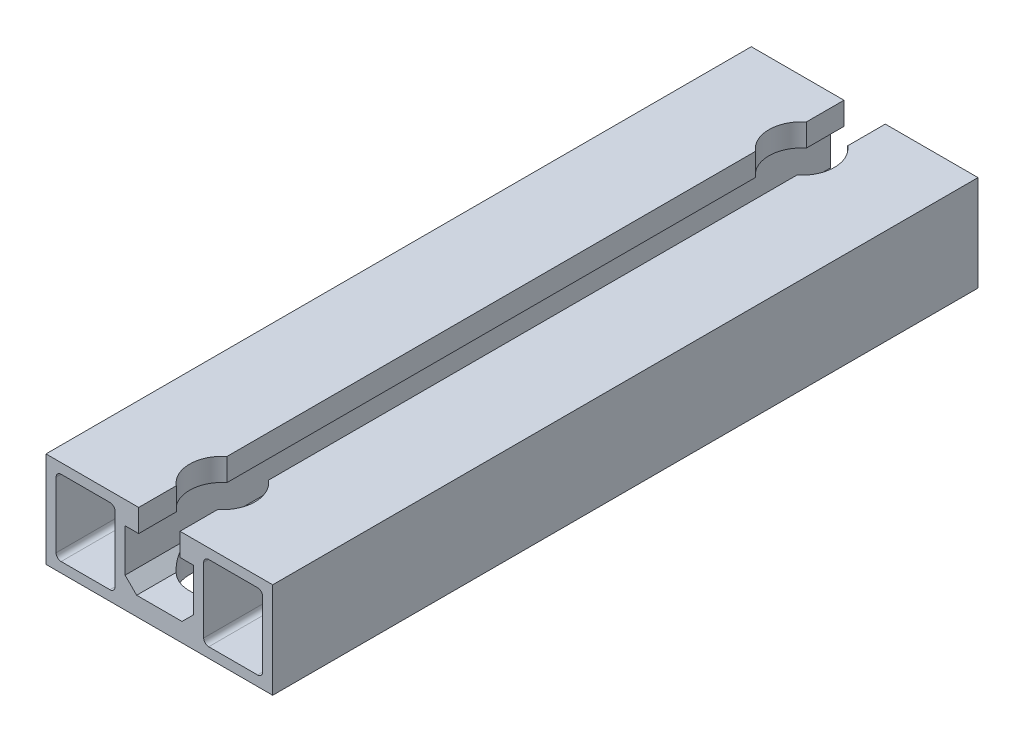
ISO-10303-21;
HEADER;
FILE_DESCRIPTION(('STEP AP214'),'2;1');
FILE_NAME('part.step','',(''),(''),'','','');
FILE_SCHEMA(('AUTOMOTIVE_DESIGN { 1 0 10303 214 1 1 1 1 }'));
ENDSEC;
DATA;
#1=APPLICATION_CONTEXT('core data for automotive mechanical design processes');
#2=APPLICATION_PROTOCOL_DEFINITION('international standard','automotive_design',2000,#1);
#3=PRODUCT_CONTEXT('',#1,'mechanical');
#4=PRODUCT('Part','Part','',(#3));
#5=PRODUCT_RELATED_PRODUCT_CATEGORY('part','',(#4));
#6=PRODUCT_DEFINITION_FORMATION('','',#4);
#7=PRODUCT_DEFINITION_CONTEXT('part definition',#1,'design');
#8=PRODUCT_DEFINITION('design','',#6,#7);
#9=PRODUCT_DEFINITION_SHAPE('','',#8);
#10=(LENGTH_UNIT() NAMED_UNIT(*) SI_UNIT(.MILLI.,.METRE.));
#11=(NAMED_UNIT(*) PLANE_ANGLE_UNIT() SI_UNIT($,.RADIAN.));
#12=(NAMED_UNIT(*) SI_UNIT($,.STERADIAN.) SOLID_ANGLE_UNIT());
#13=UNCERTAINTY_MEASURE_WITH_UNIT(LENGTH_MEASURE(1.E-05),#10,'distance_accuracy_value','');
#14=(GEOMETRIC_REPRESENTATION_CONTEXT(3) GLOBAL_UNCERTAINTY_ASSIGNED_CONTEXT((#13)) GLOBAL_UNIT_ASSIGNED_CONTEXT((#10,
#11,#12)) REPRESENTATION_CONTEXT('',''));
#15=CARTESIAN_POINT('',(0.,0.,0.));
#16=DIRECTION('',(0.,0.,1.));
#17=DIRECTION('',(1.,0.,0.));
#18=AXIS2_PLACEMENT_3D('',#15,#16,#17);
#19=CARTESIAN_POINT('',(4.50000000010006,-5.7999999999,-70.));
#20=DIRECTION('',(0.,1.,0.));
#21=DIRECTION('',(0.,0.,1.));
#22=AXIS2_PLACEMENT_3D('',#19,#20,#21);
#23=PLANE('',#22);
#24=CARTESIAN_POINT('',(0.,-5.7999999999,-57.5));
#25=DIRECTION('',(0.,1.,0.));
#26=DIRECTION('',(0.,0.,1.));
#27=AXIS2_PLACEMENT_3D('',#24,#25,#26);
#28=CIRCLE('',#27,6.5);
#29=CARTESIAN_POINT('',(4.50000000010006,-5.7999999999,-62.1904157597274));
#30=VERTEX_POINT('',#29);
#31=CARTESIAN_POINT('',(-4.49999999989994,-5.7999999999,-62.1904157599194));
#32=VERTEX_POINT('',#31);
#33=EDGE_CURVE('E637',#30,#32,#28,.T.);
#34=ORIENTED_EDGE('',*,*,#33,.F.);
#35=DIRECTION('',(0.,0.,1.));
#36=VECTOR('',#35,1.);
#37=CARTESIAN_POINT('',(4.50000000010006,-5.7999999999,-70.));
#38=LINE('',#37,#36);
#39=CARTESIAN_POINT('',(4.50000000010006,-5.7999999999,-70.));
#40=VERTEX_POINT('',#39);
#41=EDGE_CURVE('E377',#40,#30,#38,.T.);
#42=ORIENTED_EDGE('',*,*,#41,.F.);
#43=DIRECTION('',(-1.,0.,0.));
#44=VECTOR('',#43,1.);
#45=CARTESIAN_POINT('',(4.50000000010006,-5.7999999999,-70.));
#46=LINE('',#45,#44);
#47=CARTESIAN_POINT('',(-4.49999999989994,-5.7999999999,-70.));
#48=VERTEX_POINT('',#47);
#49=EDGE_CURVE('E613',#40,#48,#46,.T.);
#50=ORIENTED_EDGE('',*,*,#49,.T.);
#51=DIRECTION('',(0.,0.,1.));
#52=VECTOR('',#51,1.);
#53=CARTESIAN_POINT('',(-4.49999999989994,-5.7999999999,-70.));
#54=LINE('',#53,#52);
#55=EDGE_CURVE('E372',#48,#32,#54,.T.);
#56=ORIENTED_EDGE('',*,*,#55,.T.);
#57=EDGE_LOOP('',(#34,#42,#50,#56));
#58=FACE_BOUND('',#57,.T.);
#59=ADVANCED_FACE('F30',(#58),#23,.T.);
#60=CARTESIAN_POINT('',(4.10000000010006,9.50000000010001,-70.));
#61=DIRECTION('',(-1.,0.,0.));
#62=DIRECTION('',(0.,0.,1.));
#63=AXIS2_PLACEMENT_3D('',#60,#61,#62);
#64=PLANE('',#63);
#65=DIRECTION('',(0.,-1.,0.));
#66=VECTOR('',#65,1.);
#67=CARTESIAN_POINT('',(4.10000000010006,60.5,-62.5438080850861));
#68=LINE('',#67,#66);
#69=CARTESIAN_POINT('',(4.10000000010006,9.50000000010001,-62.5438080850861));
#70=VERTEX_POINT('',#69);
#71=CARTESIAN_POINT('',(4.10000000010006,5.0000000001,-62.5438080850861));
#72=VERTEX_POINT('',#71);
#73=EDGE_CURVE('E304',#70,#72,#68,.T.);
#74=ORIENTED_EDGE('',*,*,#73,.F.);
#75=DIRECTION('',(0.,0.,1.));
#76=VECTOR('',#75,1.);
#77=CARTESIAN_POINT('',(4.10000000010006,9.50000000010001,-70.));
#78=LINE('',#77,#76);
#79=CARTESIAN_POINT('',(4.10000000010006,9.50000000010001,-70.));
#80=VERTEX_POINT('',#79);
#81=EDGE_CURVE('E317',#80,#70,#78,.T.);
#82=ORIENTED_EDGE('',*,*,#81,.F.);
#83=DIRECTION('',(0.,-1.,0.));
#84=VECTOR('',#83,1.);
#85=CARTESIAN_POINT('',(4.10000000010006,9.50000000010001,-70.));
#86=LINE('',#85,#84);
#87=CARTESIAN_POINT('',(4.10000000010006,5.0000000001,-70.));
#88=VERTEX_POINT('',#87);
#89=EDGE_CURVE('E602',#80,#88,#86,.T.);
#90=ORIENTED_EDGE('',*,*,#89,.T.);
#91=DIRECTION('',(0.,0.,1.));
#92=VECTOR('',#91,1.);
#93=CARTESIAN_POINT('',(4.10000000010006,5.0000000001,-70.));
#94=LINE('',#93,#92);
#95=EDGE_CURVE('E319',#88,#72,#94,.T.);
#96=ORIENTED_EDGE('',*,*,#95,.T.);
#97=EDGE_LOOP('',(#74,#82,#90,#96));
#98=FACE_BOUND('',#97,.T.);
#99=ADVANCED_FACE('F315',(#98),#64,.T.);
#100=CARTESIAN_POINT('',(-4.09999999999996,4.99999999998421,-70.));
#101=DIRECTION('',(1.,0.,0.));
#102=DIRECTION('',(0.,0.,-1.));
#103=AXIS2_PLACEMENT_3D('',#100,#101,#102);
#104=PLANE('',#103);
#105=DIRECTION('',(0.,-1.,0.));
#106=VECTOR('',#105,1.);
#107=CARTESIAN_POINT('',(-4.09999999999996,60.5,-52.4561919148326));
#108=LINE('',#107,#106);
#109=CARTESIAN_POINT('',(-4.09999999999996,9.50000000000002,-52.4561919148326));
#110=VERTEX_POINT('',#109);
#111=CARTESIAN_POINT('',(-4.09999999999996,4.99999999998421,-52.4561919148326));
#112=VERTEX_POINT('',#111);
#113=EDGE_CURVE('E48',#110,#112,#108,.T.);
#114=ORIENTED_EDGE('',*,*,#113,.F.);
#115=DIRECTION('',(0.,0.,1.));
#116=VECTOR('',#115,1.);
#117=CARTESIAN_POINT('',(-4.09999999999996,9.50000000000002,-70.));
#118=LINE('',#117,#116);
#119=CARTESIAN_POINT('',(-4.09999999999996,9.50000000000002,52.4561920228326));
#120=VERTEX_POINT('',#119);
#121=EDGE_CURVE('E39',#110,#120,#118,.T.);
#122=ORIENTED_EDGE('',*,*,#121,.T.);
#123=DIRECTION('',(0.,-1.,0.));
#124=VECTOR('',#123,1.);
#125=CARTESIAN_POINT('',(-4.09999999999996,60.5,52.4561920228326));
#126=LINE('',#125,#124);
#127=CARTESIAN_POINT('',(-4.09999999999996,4.99999999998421,52.4561920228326));
#128=VERTEX_POINT('',#127);
#129=EDGE_CURVE('E418',#128,#120,#126,.F.);
#130=ORIENTED_EDGE('',*,*,#129,.F.);
#131=DIRECTION('',(0.,0.,1.));
#132=VECTOR('',#131,1.);
#133=CARTESIAN_POINT('',(-4.09999999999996,4.99999999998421,-70.));
#134=LINE('',#133,#132);
#135=EDGE_CURVE('E366',#112,#128,#134,.T.);
#136=ORIENTED_EDGE('',*,*,#135,.F.);
#137=EDGE_LOOP('',(#114,#122,#130,#136));
#138=FACE_BOUND('',#137,.T.);
#139=ADVANCED_FACE('F682',(#138),#104,.T.);
#140=DIRECTION('',(0.,-1.,0.));
#141=VECTOR('',#140,1.);
#142=CARTESIAN_POINT('',(-4.09999999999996,60.5,62.5438081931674));
#143=LINE('',#142,#141);
#144=CARTESIAN_POINT('',(-4.09999999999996,9.50000000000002,62.5438081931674));
#145=VERTEX_POINT('',#144);
#146=CARTESIAN_POINT('',(-4.09999999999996,4.99999999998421,62.5438081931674));
#147=VERTEX_POINT('',#146);
#148=EDGE_CURVE('E421',#145,#147,#143,.T.);
#149=ORIENTED_EDGE('',*,*,#148,.F.);
#150=CARTESIAN_POINT('',(-4.09999999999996,9.50000000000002,70.));
#151=VERTEX_POINT('',#150);
#152=EDGE_CURVE('E41',#145,#151,#118,.T.);
#153=ORIENTED_EDGE('',*,*,#152,.T.);
#154=DIRECTION('',(0.,1.,0.));
#155=VECTOR('',#154,1.);
#156=CARTESIAN_POINT('',(-4.09999999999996,4.99999999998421,70.));
#157=LINE('',#156,#155);
#158=CARTESIAN_POINT('',(-4.09999999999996,4.99999999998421,70.));
#159=VERTEX_POINT('',#158);
#160=EDGE_CURVE('E509',#159,#151,#157,.T.);
#161=ORIENTED_EDGE('',*,*,#160,.F.);
#162=EDGE_CURVE('E367',#147,#159,#134,.T.);
#163=ORIENTED_EDGE('',*,*,#162,.F.);
#164=EDGE_LOOP('',(#149,#153,#161,#163));
#165=FACE_BOUND('',#164,.T.);
#166=ADVANCED_FACE('F677',(#165),#104,.T.);
#167=CARTESIAN_POINT('',(-4.49999999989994,-5.7999999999,-52.8095842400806));
#168=VERTEX_POINT('',#167);
#169=CARTESIAN_POINT('',(4.50000000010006,-5.7999999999,-52.8095842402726));
#170=VERTEX_POINT('',#169);
#171=EDGE_CURVE('E56',#168,#170,#28,.T.);
#172=ORIENTED_EDGE('',*,*,#171,.F.);
#173=CARTESIAN_POINT('',(-4.49999999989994,-5.7999999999,52.8095843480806));
#174=VERTEX_POINT('',#173);
#175=EDGE_CURVE('E375',#168,#174,#54,.T.);
#176=ORIENTED_EDGE('',*,*,#175,.T.);
#177=CARTESIAN_POINT('',(0.,-5.7999999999,57.500000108));
#178=DIRECTION('',(0.,1.,0.));
#179=DIRECTION('',(0.,0.,1.));
#180=AXIS2_PLACEMENT_3D('',#177,#178,#179);
#181=CIRCLE('',#180,6.5);
#182=CARTESIAN_POINT('',(4.50000000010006,-5.7999999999,52.8095843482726));
#183=VERTEX_POINT('',#182);
#184=EDGE_CURVE('E412',#183,#174,#181,.T.);
#185=ORIENTED_EDGE('',*,*,#184,.F.);
#186=EDGE_CURVE('E380',#170,#183,#38,.T.);
#187=ORIENTED_EDGE('',*,*,#186,.F.);
#188=EDGE_LOOP('',(#172,#176,#185,#187));
#189=FACE_BOUND('',#188,.T.);
#190=ADVANCED_FACE('F700',(#189),#23,.T.);
#191=DIRECTION('',(0.,-1.,0.));
#192=VECTOR('',#191,1.);
#193=CARTESIAN_POINT('',(4.10000000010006,60.5,-52.456191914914));
#194=LINE('',#193,#192);
#195=CARTESIAN_POINT('',(4.10000000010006,5.0000000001,-52.456191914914));
#196=VERTEX_POINT('',#195);
#197=CARTESIAN_POINT('',(4.10000000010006,9.50000000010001,-52.456191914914));
#198=VERTEX_POINT('',#197);
#199=EDGE_CURVE('E307',#196,#198,#194,.F.);
#200=ORIENTED_EDGE('',*,*,#199,.F.);
#201=CARTESIAN_POINT('',(4.10000000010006,5.0000000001,52.4561920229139));
#202=VERTEX_POINT('',#201);
#203=EDGE_CURVE('E330',#196,#202,#94,.T.);
#204=ORIENTED_EDGE('',*,*,#203,.T.);
#205=DIRECTION('',(0.,-1.,0.));
#206=VECTOR('',#205,1.);
#207=CARTESIAN_POINT('',(4.10000000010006,60.5,52.4561920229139));
#208=LINE('',#207,#206);
#209=CARTESIAN_POINT('',(4.10000000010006,9.50000000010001,52.4561920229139));
#210=VERTEX_POINT('',#209);
#211=EDGE_CURVE('E390',#210,#202,#208,.T.);
#212=ORIENTED_EDGE('',*,*,#211,.F.);
#213=EDGE_CURVE('E327',#198,#210,#78,.T.);
#214=ORIENTED_EDGE('',*,*,#213,.F.);
#215=EDGE_LOOP('',(#200,#204,#212,#214));
#216=FACE_BOUND('',#215,.T.);
#217=ADVANCED_FACE('F389',(#216),#64,.T.);
#218=CARTESIAN_POINT('',(-4.09999999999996,9.50000000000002,-70.));
#219=DIRECTION('',(0.,1.,0.));
#220=DIRECTION('',(-1.,0.,0.));
#221=AXIS2_PLACEMENT_3D('',#218,#219,#220);
#222=PLANE('',#221);
#223=CARTESIAN_POINT('',(0.,9.50000000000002,-57.5));
#224=DIRECTION('',(0.,1.,0.));
#225=DIRECTION('',(-1.,0.,0.));
#226=AXIS2_PLACEMENT_3D('',#223,#224,#225);
#227=CIRCLE('',#226,6.5);
#228=CARTESIAN_POINT('',(-4.09999999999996,9.50000000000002,-62.5438080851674));
#229=VERTEX_POINT('',#228);
#230=EDGE_CURVE('E662',#229,#110,#227,.T.);
#231=ORIENTED_EDGE('',*,*,#230,.F.);
#232=CARTESIAN_POINT('',(-4.09999999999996,9.50000000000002,-70.));
#233=VERTEX_POINT('',#232);
#234=EDGE_CURVE('E11',#233,#229,#118,.T.);
#235=ORIENTED_EDGE('',*,*,#234,.F.);
#236=DIRECTION('',(-1.,0.,0.));
#237=VECTOR('',#236,1.);
#238=CARTESIAN_POINT('',(-4.09999999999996,9.50000000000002,-70.));
#239=LINE('',#238,#237);
#240=CARTESIAN_POINT('',(-22.5,9.50000000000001,-70.));
#241=VERTEX_POINT('',#240);
#242=EDGE_CURVE('E579',#233,#241,#239,.T.);
#243=ORIENTED_EDGE('',*,*,#242,.T.);
#244=DIRECTION('',(0.,0.,1.));
#245=VECTOR('',#244,1.);
#246=CARTESIAN_POINT('',(-22.5,9.50000000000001,-70.));
#247=LINE('',#246,#245);
#248=CARTESIAN_POINT('',(-22.5,9.50000000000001,70.));
#249=VERTEX_POINT('',#248);
#250=EDGE_CURVE('E34',#241,#249,#247,.T.);
#251=ORIENTED_EDGE('',*,*,#250,.T.);
#252=DIRECTION('',(-1.,0.,0.));
#253=VECTOR('',#252,1.);
#254=CARTESIAN_POINT('',(-4.09999999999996,9.50000000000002,70.));
#255=LINE('',#254,#253);
#256=EDGE_CURVE('E473',#151,#249,#255,.T.);
#257=ORIENTED_EDGE('',*,*,#256,.F.);
#258=ORIENTED_EDGE('',*,*,#152,.F.);
#259=CARTESIAN_POINT('',(0.,9.50000000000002,57.500000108));
#260=DIRECTION('',(0.,1.,0.));
#261=DIRECTION('',(-1.,0.,0.));
#262=AXIS2_PLACEMENT_3D('',#259,#260,#261);
#263=CIRCLE('',#262,6.5);
#264=EDGE_CURVE('E423',#120,#145,#263,.T.);
#265=ORIENTED_EDGE('',*,*,#264,.F.);
#266=ORIENTED_EDGE('',*,*,#121,.F.);
#267=EDGE_LOOP('',(#231,#235,#243,#251,#257,#258,#265,#266));
#268=FACE_BOUND('',#267,.T.);
#269=ADVANCED_FACE('F32',(#268),#222,.T.);
#270=DIRECTION('',(0.,-1.,0.));
#271=VECTOR('',#270,1.);
#272=CARTESIAN_POINT('',(-4.09999999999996,60.5,-62.5438080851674));
#273=LINE('',#272,#271);
#274=CARTESIAN_POINT('',(-4.09999999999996,4.99999999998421,-62.5438080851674));
#275=VERTEX_POINT('',#274);
#276=EDGE_CURVE('E665',#275,#229,#273,.F.);
#277=ORIENTED_EDGE('',*,*,#276,.F.);
#278=CARTESIAN_POINT('',(-4.09999999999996,4.99999999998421,-70.));
#279=VERTEX_POINT('',#278);
#280=EDGE_CURVE('E363',#279,#275,#134,.T.);
#281=ORIENTED_EDGE('',*,*,#280,.F.);
#282=DIRECTION('',(0.,1.,0.));
#283=VECTOR('',#282,1.);
#284=CARTESIAN_POINT('',(-4.09999999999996,4.99999999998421,-70.));
#285=LINE('',#284,#283);
#286=EDGE_CURVE('E349',#279,#233,#285,.T.);
#287=ORIENTED_EDGE('',*,*,#286,.T.);
#288=ORIENTED_EDGE('',*,*,#234,.T.);
#289=EDGE_LOOP('',(#277,#281,#287,#288));
#290=FACE_BOUND('',#289,.T.);
#291=ADVANCED_FACE('F664',(#290),#104,.T.);
#292=CARTESIAN_POINT('',(-6.79999999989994,4.99999999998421,-70.));
#293=DIRECTION('',(0.,-1.,0.));
#294=DIRECTION('',(0.,0.,-1.));
#295=AXIS2_PLACEMENT_3D('',#292,#293,#294);
#296=PLANE('',#295);
#297=CARTESIAN_POINT('',(0.,4.99999999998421,-57.5));
#298=DIRECTION('',(0.,-1.,0.));
#299=DIRECTION('',(0.,0.,-1.));
#300=AXIS2_PLACEMENT_3D('',#297,#298,#299);
#301=CIRCLE('',#300,6.5);
#302=EDGE_CURVE('E666',#112,#275,#301,.T.);
#303=ORIENTED_EDGE('',*,*,#302,.F.);
#304=ORIENTED_EDGE('',*,*,#135,.T.);
#305=CARTESIAN_POINT('',(0.,4.99999999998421,57.500000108));
#306=DIRECTION('',(0.,-1.,0.));
#307=DIRECTION('',(0.,0.,-1.));
#308=AXIS2_PLACEMENT_3D('',#305,#306,#307);
#309=CIRCLE('',#308,6.5);
#310=EDGE_CURVE('E415',#147,#128,#309,.T.);
#311=ORIENTED_EDGE('',*,*,#310,.F.);
#312=ORIENTED_EDGE('',*,*,#162,.T.);
#313=DIRECTION('',(1.,0.,0.));
#314=VECTOR('',#313,1.);
#315=CARTESIAN_POINT('',(-6.79999999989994,4.99999999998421,70.));
#316=LINE('',#315,#314);
#317=CARTESIAN_POINT('',(-6.79999999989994,4.99999999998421,70.));
#318=VERTEX_POINT('',#317);
#319=EDGE_CURVE('E506',#318,#159,#316,.T.);
#320=ORIENTED_EDGE('',*,*,#319,.F.);
#321=DIRECTION('',(0.,0.,1.));
#322=VECTOR('',#321,1.);
#323=CARTESIAN_POINT('',(-6.79999999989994,4.99999999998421,-70.));
#324=LINE('',#323,#322);
#325=CARTESIAN_POINT('',(-6.79999999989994,4.99999999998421,-70.));
#326=VERTEX_POINT('',#325);
#327=EDGE_CURVE('E368',#326,#318,#324,.T.);
#328=ORIENTED_EDGE('',*,*,#327,.F.);
#329=DIRECTION('',(1.,0.,0.));
#330=VECTOR('',#329,1.);
#331=CARTESIAN_POINT('',(-6.79999999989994,4.99999999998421,-70.));
#332=LINE('',#331,#330);
#333=EDGE_CURVE('E354',#326,#279,#332,.T.);
#334=ORIENTED_EDGE('',*,*,#333,.T.);
#335=ORIENTED_EDGE('',*,*,#280,.T.);
#336=EDGE_LOOP('',(#303,#304,#311,#312,#320,#328,#334,#335));
#337=FACE_BOUND('',#336,.T.);
#338=ADVANCED_FACE('F669',(#337),#296,.T.);
#339=CARTESIAN_POINT('',(-6.79999999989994,-3.4999999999,-70.));
#340=DIRECTION('',(1.,0.,0.));
#341=DIRECTION('',(0.,0.,-1.));
#342=AXIS2_PLACEMENT_3D('',#339,#340,#341);
#343=PLANE('',#342);
#344=ORIENTED_EDGE('',*,*,#327,.T.);
#345=DIRECTION('',(0.,1.,0.));
#346=VECTOR('',#345,1.);
#347=CARTESIAN_POINT('',(-6.79999999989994,-3.4999999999,70.));
#348=LINE('',#347,#346);
#349=CARTESIAN_POINT('',(-6.79999999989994,-3.4999999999,70.));
#350=VERTEX_POINT('',#349);
#351=EDGE_CURVE('E503',#350,#318,#348,.T.);
#352=ORIENTED_EDGE('',*,*,#351,.F.);
#353=DIRECTION('',(0.,0.,1.));
#354=VECTOR('',#353,1.);
#355=CARTESIAN_POINT('',(-6.79999999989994,-3.4999999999,-70.));
#356=LINE('',#355,#354);
#357=CARTESIAN_POINT('',(-6.79999999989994,-3.4999999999,-70.));
#358=VERTEX_POINT('',#357);
#359=EDGE_CURVE('E370',#358,#350,#356,.T.);
#360=ORIENTED_EDGE('',*,*,#359,.F.);
#361=DIRECTION('',(0.,1.,0.));
#362=VECTOR('',#361,1.);
#363=CARTESIAN_POINT('',(-6.79999999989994,-3.4999999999,-70.));
#364=LINE('',#363,#362);
#365=EDGE_CURVE('E359',#358,#326,#364,.T.);
#366=ORIENTED_EDGE('',*,*,#365,.T.);
#367=EDGE_LOOP('',(#344,#352,#360,#366));
#368=FACE_BOUND('',#367,.T.);
#369=ADVANCED_FACE('F621',(#368),#343,.T.);
#370=CARTESIAN_POINT('',(-4.49999999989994,-5.7999999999,-70.));
#371=DIRECTION('',(0.707106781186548,0.707106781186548,0.));
#372=DIRECTION('',(-0.707106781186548,0.707106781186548,0.));
#373=AXIS2_PLACEMENT_3D('',#370,#371,#372);
#374=PLANE('',#373);
#375=CARTESIAN_POINT('',(0.,-10.2999999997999,-57.5));
#376=DIRECTION('',(0.707106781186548,0.707106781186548,0.));
#377=DIRECTION('',(0.707106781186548,-0.707106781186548,0.));
#378=AXIS2_PLACEMENT_3D('',#375,#376,#377);
#379=ELLIPSE('',#378,9.19238815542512,6.5);
#380=EDGE_CURVE('E634',#32,#168,#379,.T.);
#381=ORIENTED_EDGE('',*,*,#380,.F.);
#382=ORIENTED_EDGE('',*,*,#55,.F.);
#383=DIRECTION('',(-0.707106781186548,0.707106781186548,0.));
#384=VECTOR('',#383,1.);
#385=CARTESIAN_POINT('',(-4.49999999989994,-5.7999999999,-70.));
#386=LINE('',#385,#384);
#387=EDGE_CURVE('E616',#48,#358,#386,.T.);
#388=ORIENTED_EDGE('',*,*,#387,.T.);
#389=ORIENTED_EDGE('',*,*,#359,.T.);
#390=DIRECTION('',(-0.707106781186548,0.707106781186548,0.));
#391=VECTOR('',#390,1.);
#392=CARTESIAN_POINT('',(-4.49999999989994,-5.7999999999,70.));
#393=LINE('',#392,#391);
#394=CARTESIAN_POINT('',(-4.49999999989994,-5.7999999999,70.));
#395=VERTEX_POINT('',#394);
#396=EDGE_CURVE('E500',#395,#350,#393,.T.);
#397=ORIENTED_EDGE('',*,*,#396,.F.);
#398=CARTESIAN_POINT('',(-4.49999999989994,-5.7999999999,62.1904158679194));
#399=VERTEX_POINT('',#398);
#400=EDGE_CURVE('E376',#399,#395,#54,.T.);
#401=ORIENTED_EDGE('',*,*,#400,.F.);
#402=CARTESIAN_POINT('',(0.,-10.2999999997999,57.500000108));
#403=DIRECTION('',(0.707106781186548,0.707106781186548,0.));
#404=DIRECTION('',(0.707106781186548,-0.707106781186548,0.));
#405=AXIS2_PLACEMENT_3D('',#402,#403,#404);
#406=ELLIPSE('',#405,9.19238815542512,6.5);
#407=EDGE_CURVE('E413',#174,#399,#406,.T.);
#408=ORIENTED_EDGE('',*,*,#407,.F.);
#409=ORIENTED_EDGE('',*,*,#175,.F.);
#410=EDGE_LOOP('',(#381,#382,#388,#389,#397,#401,#408,#409));
#411=FACE_BOUND('',#410,.T.);
#412=ADVANCED_FACE('F631',(#411),#374,.T.);
#413=CARTESIAN_POINT('',(4.50000000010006,-5.7999999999,62.1904158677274));
#414=VERTEX_POINT('',#413);
#415=EDGE_CURVE('E407',#399,#414,#181,.T.);
#416=ORIENTED_EDGE('',*,*,#415,.F.);
#417=ORIENTED_EDGE('',*,*,#400,.T.);
#418=DIRECTION('',(-1.,0.,0.));
#419=VECTOR('',#418,1.);
#420=CARTESIAN_POINT('',(4.50000000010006,-5.7999999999,70.));
#421=LINE('',#420,#419);
#422=CARTESIAN_POINT('',(4.50000000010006,-5.7999999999,70.));
#423=VERTEX_POINT('',#422);
#424=EDGE_CURVE('E497',#423,#395,#421,.T.);
#425=ORIENTED_EDGE('',*,*,#424,.F.);
#426=EDGE_CURVE('E381',#414,#423,#38,.T.);
#427=ORIENTED_EDGE('',*,*,#426,.F.);
#428=EDGE_LOOP('',(#416,#417,#425,#427));
#429=FACE_BOUND('',#428,.T.);
#430=ADVANCED_FACE('F701',(#429),#23,.T.);
#431=CARTESIAN_POINT('',(6.80000000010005,-3.4999999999,-70.));
#432=DIRECTION('',(-0.707106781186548,0.707106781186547,0.));
#433=DIRECTION('',(-0.707106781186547,-0.707106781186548,0.));
#434=AXIS2_PLACEMENT_3D('',#431,#432,#433);
#435=PLANE('',#434);
#436=CARTESIAN_POINT('',(0.,-10.3000000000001,-57.5));
#437=DIRECTION('',(-0.707106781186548,0.707106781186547,0.));
#438=DIRECTION('',(-0.707106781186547,-0.707106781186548,0.));
#439=AXIS2_PLACEMENT_3D('',#436,#437,#438);
#440=ELLIPSE('',#439,9.19238815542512,6.5);
#441=EDGE_CURVE('E726',#170,#30,#440,.T.);
#442=ORIENTED_EDGE('',*,*,#441,.F.);
#443=ORIENTED_EDGE('',*,*,#186,.T.);
#444=CARTESIAN_POINT('',(0.,-10.3000000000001,57.500000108));
#445=DIRECTION('',(-0.707106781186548,0.707106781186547,0.));
#446=DIRECTION('',(-0.707106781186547,-0.707106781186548,0.));
#447=AXIS2_PLACEMENT_3D('',#444,#445,#446);
#448=ELLIPSE('',#447,9.19238815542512,6.5);
#449=EDGE_CURVE('E404',#414,#183,#448,.T.);
#450=ORIENTED_EDGE('',*,*,#449,.F.);
#451=ORIENTED_EDGE('',*,*,#426,.T.);
#452=DIRECTION('',(-0.707106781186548,-0.707106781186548,0.));
#453=VECTOR('',#452,1.);
#454=CARTESIAN_POINT('',(6.80000000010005,-3.4999999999,70.));
#455=LINE('',#454,#453);
#456=CARTESIAN_POINT('',(6.80000000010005,-3.4999999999,70.));
#457=VERTEX_POINT('',#456);
#458=EDGE_CURVE('E494',#457,#423,#455,.T.);
#459=ORIENTED_EDGE('',*,*,#458,.F.);
#460=DIRECTION('',(0.,0.,1.));
#461=VECTOR('',#460,1.);
#462=CARTESIAN_POINT('',(6.80000000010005,-3.4999999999,-70.));
#463=LINE('',#462,#461);
#464=CARTESIAN_POINT('',(6.80000000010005,-3.4999999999,-70.));
#465=VERTEX_POINT('',#464);
#466=EDGE_CURVE('E382',#465,#457,#463,.T.);
#467=ORIENTED_EDGE('',*,*,#466,.F.);
#468=DIRECTION('',(-0.707106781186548,-0.707106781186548,0.));
#469=VECTOR('',#468,1.);
#470=CARTESIAN_POINT('',(6.80000000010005,-3.4999999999,-70.));
#471=LINE('',#470,#469);
#472=EDGE_CURVE('E610',#465,#40,#471,.T.);
#473=ORIENTED_EDGE('',*,*,#472,.T.);
#474=ORIENTED_EDGE('',*,*,#41,.T.);
#475=EDGE_LOOP('',(#442,#443,#450,#451,#459,#467,#473,#474));
#476=FACE_BOUND('',#475,.T.);
#477=ADVANCED_FACE('F641',(#476),#435,.T.);
#478=CARTESIAN_POINT('',(6.80000000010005,5.0000000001,-70.));
#479=DIRECTION('',(-1.,0.,0.));
#480=DIRECTION('',(0.,0.,1.));
#481=AXIS2_PLACEMENT_3D('',#478,#479,#480);
#482=PLANE('',#481);
#483=ORIENTED_EDGE('',*,*,#466,.T.);
#484=DIRECTION('',(0.,-1.,0.));
#485=VECTOR('',#484,1.);
#486=CARTESIAN_POINT('',(6.80000000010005,5.0000000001,70.));
#487=LINE('',#486,#485);
#488=CARTESIAN_POINT('',(6.80000000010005,5.0000000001,70.));
#489=VERTEX_POINT('',#488);
#490=EDGE_CURVE('E491',#489,#457,#487,.T.);
#491=ORIENTED_EDGE('',*,*,#490,.F.);
#492=DIRECTION('',(0.,0.,1.));
#493=VECTOR('',#492,1.);
#494=CARTESIAN_POINT('',(6.80000000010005,5.0000000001,-70.));
#495=LINE('',#494,#493);
#496=CARTESIAN_POINT('',(6.80000000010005,5.0000000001,-70.));
#497=VERTEX_POINT('',#496);
#498=EDGE_CURVE('E384',#497,#489,#495,.T.);
#499=ORIENTED_EDGE('',*,*,#498,.F.);
#500=DIRECTION('',(0.,-1.,0.));
#501=VECTOR('',#500,1.);
#502=CARTESIAN_POINT('',(6.80000000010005,5.0000000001,-70.));
#503=LINE('',#502,#501);
#504=EDGE_CURVE('E607',#497,#465,#503,.T.);
#505=ORIENTED_EDGE('',*,*,#504,.T.);
#506=EDGE_LOOP('',(#483,#491,#499,#505));
#507=FACE_BOUND('',#506,.T.);
#508=ADVANCED_FACE('F645',(#507),#482,.T.);
#509=CARTESIAN_POINT('',(4.10000000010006,5.0000000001,-70.));
#510=DIRECTION('',(0.,-1.,0.));
#511=DIRECTION('',(0.,0.,-1.));
#512=AXIS2_PLACEMENT_3D('',#509,#510,#511);
#513=PLANE('',#512);
#514=CARTESIAN_POINT('',(0.,5.0000000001,-57.5));
#515=DIRECTION('',(0.,-1.,0.));
#516=DIRECTION('',(0.,0.,-1.));
#517=AXIS2_PLACEMENT_3D('',#514,#515,#516);
#518=CIRCLE('',#517,6.5);
#519=EDGE_CURVE('E320',#72,#196,#518,.T.);
#520=ORIENTED_EDGE('',*,*,#519,.F.);
#521=ORIENTED_EDGE('',*,*,#95,.F.);
#522=DIRECTION('',(1.,0.,0.));
#523=VECTOR('',#522,1.);
#524=CARTESIAN_POINT('',(4.10000000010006,5.0000000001,-70.));
#525=LINE('',#524,#523);
#526=EDGE_CURVE('E604',#88,#497,#525,.T.);
#527=ORIENTED_EDGE('',*,*,#526,.T.);
#528=ORIENTED_EDGE('',*,*,#498,.T.);
#529=DIRECTION('',(1.,0.,0.));
#530=VECTOR('',#529,1.);
#531=CARTESIAN_POINT('',(4.10000000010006,5.0000000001,70.));
#532=LINE('',#531,#530);
#533=CARTESIAN_POINT('',(4.10000000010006,5.0000000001,70.));
#534=VERTEX_POINT('',#533);
#535=EDGE_CURVE('E488',#534,#489,#532,.T.);
#536=ORIENTED_EDGE('',*,*,#535,.F.);
#537=CARTESIAN_POINT('',(4.10000000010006,5.0000000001,62.5438081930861));
#538=VERTEX_POINT('',#537);
#539=EDGE_CURVE('E326',#538,#534,#94,.T.);
#540=ORIENTED_EDGE('',*,*,#539,.F.);
#541=CARTESIAN_POINT('',(0.,5.0000000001,57.500000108));
#542=DIRECTION('',(0.,-1.,0.));
#543=DIRECTION('',(0.,0.,-1.));
#544=AXIS2_PLACEMENT_3D('',#541,#542,#543);
#545=CIRCLE('',#544,6.5);
#546=EDGE_CURVE('E396',#202,#538,#545,.T.);
#547=ORIENTED_EDGE('',*,*,#546,.F.);
#548=ORIENTED_EDGE('',*,*,#203,.F.);
#549=EDGE_LOOP('',(#520,#521,#527,#528,#536,#540,#547,#548));
#550=FACE_BOUND('',#549,.T.);
#551=ADVANCED_FACE('F402',(#550),#513,.T.);
#552=DIRECTION('',(0.,-1.,0.));
#553=VECTOR('',#552,1.);
#554=CARTESIAN_POINT('',(4.10000000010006,60.5,62.5438081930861));
#555=LINE('',#554,#553);
#556=CARTESIAN_POINT('',(4.10000000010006,9.50000000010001,62.5438081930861));
#557=VERTEX_POINT('',#556);
#558=EDGE_CURVE('E399',#538,#557,#555,.F.);
#559=ORIENTED_EDGE('',*,*,#558,.F.);
#560=ORIENTED_EDGE('',*,*,#539,.T.);
#561=DIRECTION('',(0.,-1.,0.));
#562=VECTOR('',#561,1.);
#563=CARTESIAN_POINT('',(4.10000000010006,9.50000000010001,70.));
#564=LINE('',#563,#562);
#565=CARTESIAN_POINT('',(4.10000000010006,9.50000000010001,70.));
#566=VERTEX_POINT('',#565);
#567=EDGE_CURVE('E485',#566,#534,#564,.T.);
#568=ORIENTED_EDGE('',*,*,#567,.F.);
#569=EDGE_CURVE('E329',#557,#566,#78,.T.);
#570=ORIENTED_EDGE('',*,*,#569,.F.);
#571=EDGE_LOOP('',(#559,#560,#568,#570));
#572=FACE_BOUND('',#571,.T.);
#573=ADVANCED_FACE('F706',(#572),#64,.T.);
#574=CARTESIAN_POINT('',(22.5,9.50000000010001,-70.));
#575=DIRECTION('',(0.,1.,0.));
#576=DIRECTION('',(0.,0.,1.));
#577=AXIS2_PLACEMENT_3D('',#574,#575,#576);
#578=PLANE('',#577);
#579=CARTESIAN_POINT('',(0.,9.50000000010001,-57.5));
#580=DIRECTION('',(0.,1.,0.));
#581=DIRECTION('',(0.,0.,1.));
#582=AXIS2_PLACEMENT_3D('',#579,#580,#581);
#583=CIRCLE('',#582,6.5);
#584=EDGE_CURVE('E301',#198,#70,#583,.T.);
#585=ORIENTED_EDGE('',*,*,#584,.F.);
#586=ORIENTED_EDGE('',*,*,#213,.T.);
#587=CARTESIAN_POINT('',(0.,9.50000000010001,57.500000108));
#588=DIRECTION('',(0.,1.,0.));
#589=DIRECTION('',(0.,0.,1.));
#590=AXIS2_PLACEMENT_3D('',#587,#588,#589);
#591=CIRCLE('',#590,6.5);
#592=EDGE_CURVE('E398',#557,#210,#591,.T.);
#593=ORIENTED_EDGE('',*,*,#592,.F.);
#594=ORIENTED_EDGE('',*,*,#569,.T.);
#595=DIRECTION('',(-1.,0.,0.));
#596=VECTOR('',#595,1.);
#597=CARTESIAN_POINT('',(22.5,9.50000000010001,70.));
#598=LINE('',#597,#596);
#599=CARTESIAN_POINT('',(22.5,9.50000000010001,70.));
#600=VERTEX_POINT('',#599);
#601=EDGE_CURVE('E483',#600,#566,#598,.T.);
#602=ORIENTED_EDGE('',*,*,#601,.F.);
#603=DIRECTION('',(0.,0.,1.));
#604=VECTOR('',#603,1.);
#605=CARTESIAN_POINT('',(22.5,9.50000000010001,-70.));
#606=LINE('',#605,#604);
#607=CARTESIAN_POINT('',(22.5,9.50000000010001,-70.));
#608=VERTEX_POINT('',#607);
#609=EDGE_CURVE('E333',#608,#600,#606,.T.);
#610=ORIENTED_EDGE('',*,*,#609,.F.);
#611=DIRECTION('',(-1.,0.,0.));
#612=VECTOR('',#611,1.);
#613=CARTESIAN_POINT('',(22.5,9.50000000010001,-70.));
#614=LINE('',#613,#612);
#615=EDGE_CURVE('E325',#608,#80,#614,.T.);
#616=ORIENTED_EDGE('',*,*,#615,.T.);
#617=ORIENTED_EDGE('',*,*,#81,.T.);
#618=EDGE_LOOP('',(#585,#586,#593,#594,#602,#610,#616,#617));
#619=FACE_BOUND('',#618,.T.);
#620=ADVANCED_FACE('F323',(#619),#578,.T.);
#621=CARTESIAN_POINT('',(22.5,-9.5,-70.));
#622=DIRECTION('',(1.,0.,0.));
#623=DIRECTION('',(0.,0.,-1.));
#624=AXIS2_PLACEMENT_3D('',#621,#622,#623);
#625=PLANE('',#624);
#626=ORIENTED_EDGE('',*,*,#609,.T.);
#627=DIRECTION('',(0.,1.,0.));
#628=VECTOR('',#627,1.);
#629=CARTESIAN_POINT('',(22.5,-9.5,70.));
#630=LINE('',#629,#628);
#631=CARTESIAN_POINT('',(22.5,-9.5,70.));
#632=VERTEX_POINT('',#631);
#633=EDGE_CURVE('E481',#632,#600,#630,.T.);
#634=ORIENTED_EDGE('',*,*,#633,.F.);
#635=DIRECTION('',(0.,0.,1.));
#636=VECTOR('',#635,1.);
#637=CARTESIAN_POINT('',(22.5,-9.5,-70.));
#638=LINE('',#637,#636);
#639=CARTESIAN_POINT('',(22.5,-9.5,-70.));
#640=VERTEX_POINT('',#639);
#641=EDGE_CURVE('E338',#640,#632,#638,.T.);
#642=ORIENTED_EDGE('',*,*,#641,.F.);
#643=DIRECTION('',(0.,1.,0.));
#644=VECTOR('',#643,1.);
#645=CARTESIAN_POINT('',(22.5,-9.5,-70.));
#646=LINE('',#645,#644);
#647=EDGE_CURVE('E599',#640,#608,#646,.T.);
#648=ORIENTED_EDGE('',*,*,#647,.T.);
#649=EDGE_LOOP('',(#626,#634,#642,#648));
#650=FACE_BOUND('',#649,.T.);
#651=ADVANCED_FACE('F654',(#650),#625,.T.);
#652=CARTESIAN_POINT('',(-22.5,-9.5,-70.));
#653=DIRECTION('',(0.,-1.,0.));
#654=DIRECTION('',(0.,0.,-1.));
#655=AXIS2_PLACEMENT_3D('',#652,#653,#654);
#656=PLANE('',#655);
#657=CARTESIAN_POINT('',(0.,-9.5,-57.5));
#658=DIRECTION('',(0.,-1.,0.));
#659=DIRECTION('',(0.,0.,-1.));
#660=AXIS2_PLACEMENT_3D('',#657,#658,#659);
#661=CIRCLE('',#660,6.5);
#662=CARTESIAN_POINT('',(0.,-9.5,-64.));
#663=VERTEX_POINT('',#662);
#664=EDGE_CURVE('E311',#663,#663,#661,.T.);
#665=ORIENTED_EDGE('',*,*,#664,.F.);
#666=EDGE_LOOP('',(#665));
#667=FACE_BOUND('',#666,.T.);
#668=CARTESIAN_POINT('',(0.,-9.5,57.500000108));
#669=DIRECTION('',(0.,-1.,0.));
#670=DIRECTION('',(0.,0.,-1.));
#671=AXIS2_PLACEMENT_3D('',#668,#669,#670);
#672=CIRCLE('',#671,6.5);
#673=CARTESIAN_POINT('',(0.,-9.5,51.000000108));
#674=VERTEX_POINT('',#673);
#675=EDGE_CURVE('E735',#674,#674,#672,.T.);
#676=ORIENTED_EDGE('',*,*,#675,.F.);
#677=EDGE_LOOP('',(#676));
#678=FACE_BOUND('',#677,.T.);
#679=ORIENTED_EDGE('',*,*,#641,.T.);
#680=DIRECTION('',(1.,0.,0.));
#681=VECTOR('',#680,1.);
#682=CARTESIAN_POINT('',(-22.5,-9.5,70.));
#683=LINE('',#682,#681);
#684=CARTESIAN_POINT('',(-22.5,-9.5,70.));
#685=VERTEX_POINT('',#684);
#686=EDGE_CURVE('E478',#685,#632,#683,.T.);
#687=ORIENTED_EDGE('',*,*,#686,.F.);
#688=DIRECTION('',(0.,0.,1.));
#689=VECTOR('',#688,1.);
#690=CARTESIAN_POINT('',(-22.5,-9.5,-70.));
#691=LINE('',#690,#689);
#692=CARTESIAN_POINT('',(-22.5,-9.5,-70.));
#693=VERTEX_POINT('',#692);
#694=EDGE_CURVE('E343',#693,#685,#691,.T.);
#695=ORIENTED_EDGE('',*,*,#694,.F.);
#696=DIRECTION('',(1.,0.,0.));
#697=VECTOR('',#696,1.);
#698=CARTESIAN_POINT('',(-22.5,-9.5,-70.));
#699=LINE('',#698,#697);
#700=EDGE_CURVE('E596',#693,#640,#699,.T.);
#701=ORIENTED_EDGE('',*,*,#700,.T.);
#702=EDGE_LOOP('',(#679,#687,#695,#701));
#703=FACE_BOUND('',#702,.T.);
#704=ADVANCED_FACE('F657',(#667,#678,#703),#656,.T.);
#705=CARTESIAN_POINT('',(-22.5,9.50000000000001,-70.));
#706=DIRECTION('',(-1.,0.,0.));
#707=DIRECTION('',(0.,0.,1.));
#708=AXIS2_PLACEMENT_3D('',#705,#706,#707);
#709=PLANE('',#708);
#710=ORIENTED_EDGE('',*,*,#694,.T.);
#711=DIRECTION('',(0.,-1.,0.));
#712=VECTOR('',#711,1.);
#713=CARTESIAN_POINT('',(-22.5,9.50000000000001,70.));
#714=LINE('',#713,#712);
#715=EDGE_CURVE('E476',#249,#685,#714,.T.);
#716=ORIENTED_EDGE('',*,*,#715,.F.);
#717=ORIENTED_EDGE('',*,*,#250,.F.);
#718=DIRECTION('',(0.,-1.,0.));
#719=VECTOR('',#718,1.);
#720=CARTESIAN_POINT('',(-22.5,9.50000000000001,-70.));
#721=LINE('',#720,#719);
#722=EDGE_CURVE('E594',#241,#693,#721,.T.);
#723=ORIENTED_EDGE('',*,*,#722,.T.);
#724=EDGE_LOOP('',(#710,#716,#717,#723));
#725=FACE_BOUND('',#724,.T.);
#726=ADVANCED_FACE('F658',(#725),#709,.T.);
#727=CARTESIAN_POINT('',(-22.5,9.50000000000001,-70.));
#728=DIRECTION('',(0.,0.,1.));
#729=DIRECTION('',(1.,0.,0.));
#730=AXIS2_PLACEMENT_3D('',#727,#728,#729);
#731=PLANE('',#730);
#732=DIRECTION('',(1.,0.,0.));
#733=VECTOR('',#732,1.);
#734=CARTESIAN_POINT('',(-9.79999999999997,-7.5,-70.));
#735=LINE('',#734,#733);
#736=CARTESIAN_POINT('',(-19.5,-7.5,-70.));
#737=VERTEX_POINT('',#736);
#738=CARTESIAN_POINT('',(-9.79999999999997,-7.5,-70.));
#739=VERTEX_POINT('',#738);
#740=EDGE_CURVE('E533',#737,#739,#735,.T.);
#741=ORIENTED_EDGE('',*,*,#740,.T.);
#742=CARTESIAN_POINT('',(-9.79999999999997,-6.49999999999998,-70.));
#743=DIRECTION('',(0.,0.,1.));
#744=DIRECTION('',(1.,0.,0.));
#745=AXIS2_PLACEMENT_3D('',#742,#743,#744);
#746=CIRCLE('',#745,1.);
#747=CARTESIAN_POINT('',(-8.79999999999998,-6.49999999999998,-70.));
#748=VERTEX_POINT('',#747);
#749=EDGE_CURVE('E512',#739,#748,#746,.T.);
#750=ORIENTED_EDGE('',*,*,#749,.T.);
#751=DIRECTION('',(0.,1.,0.));
#752=VECTOR('',#751,1.);
#753=CARTESIAN_POINT('',(-8.79999999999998,6.50000000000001,-70.));
#754=LINE('',#753,#752);
#755=CARTESIAN_POINT('',(-8.79999999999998,6.50000000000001,-70.));
#756=VERTEX_POINT('',#755);
#757=EDGE_CURVE('E515',#748,#756,#754,.T.);
#758=ORIENTED_EDGE('',*,*,#757,.T.);
#759=CARTESIAN_POINT('',(-9.79999999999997,6.50000000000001,-70.));
#760=DIRECTION('',(0.,0.,1.));
#761=DIRECTION('',(1.,0.,0.));
#762=AXIS2_PLACEMENT_3D('',#759,#760,#761);
#763=CIRCLE('',#762,0.999999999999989);
#764=CARTESIAN_POINT('',(-9.79999999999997,7.5,-70.));
#765=VERTEX_POINT('',#764);
#766=EDGE_CURVE('E518',#756,#765,#763,.T.);
#767=ORIENTED_EDGE('',*,*,#766,.T.);
#768=DIRECTION('',(-1.,0.,0.));
#769=VECTOR('',#768,1.);
#770=CARTESIAN_POINT('',(-19.5,7.5,-70.));
#771=LINE('',#770,#769);
#772=CARTESIAN_POINT('',(-19.5,7.5,-70.));
#773=VERTEX_POINT('',#772);
#774=EDGE_CURVE('E521',#765,#773,#771,.T.);
#775=ORIENTED_EDGE('',*,*,#774,.T.);
#776=CARTESIAN_POINT('',(-19.5,6.50000000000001,-70.));
#777=DIRECTION('',(0.,0.,1.));
#778=DIRECTION('',(1.,0.,0.));
#779=AXIS2_PLACEMENT_3D('',#776,#777,#778);
#780=CIRCLE('',#779,0.99999999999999);
#781=CARTESIAN_POINT('',(-20.5,6.50000000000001,-70.));
#782=VERTEX_POINT('',#781);
#783=EDGE_CURVE('E524',#773,#782,#780,.T.);
#784=ORIENTED_EDGE('',*,*,#783,.T.);
#785=DIRECTION('',(0.,-1.,0.));
#786=VECTOR('',#785,1.);
#787=CARTESIAN_POINT('',(-20.5,-6.49999999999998,-70.));
#788=LINE('',#787,#786);
#789=CARTESIAN_POINT('',(-20.5,-6.49999999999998,-70.));
#790=VERTEX_POINT('',#789);
#791=EDGE_CURVE('E527',#782,#790,#788,.T.);
#792=ORIENTED_EDGE('',*,*,#791,.T.);
#793=CARTESIAN_POINT('',(-19.5,-6.49999999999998,-70.));
#794=DIRECTION('',(0.,0.,1.));
#795=DIRECTION('',(1.,0.,0.));
#796=AXIS2_PLACEMENT_3D('',#793,#794,#795);
#797=CIRCLE('',#796,1.);
#798=EDGE_CURVE('E530',#790,#737,#797,.T.);
#799=ORIENTED_EDGE('',*,*,#798,.T.);
#800=EDGE_LOOP('',(#741,#750,#758,#767,#775,#784,#792,#799));
#801=FACE_BOUND('',#800,.T.);
#802=DIRECTION('',(1.,0.,0.));
#803=VECTOR('',#802,1.);
#804=CARTESIAN_POINT('',(19.5,-7.49999999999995,-70.));
#805=LINE('',#804,#803);
#806=CARTESIAN_POINT('',(9.80000000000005,-7.49999999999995,-70.));
#807=VERTEX_POINT('',#806);
#808=CARTESIAN_POINT('',(19.5,-7.49999999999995,-70.));
#809=VERTEX_POINT('',#808);
#810=EDGE_CURVE('E573',#807,#809,#805,.T.);
#811=ORIENTED_EDGE('',*,*,#810,.T.);
#812=CARTESIAN_POINT('',(19.5,-6.49999999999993,-70.));
#813=DIRECTION('',(0.,0.,1.));
#814=DIRECTION('',(1.,0.,0.));
#815=AXIS2_PLACEMENT_3D('',#812,#813,#814);
#816=CIRCLE('',#815,1.);
#817=CARTESIAN_POINT('',(20.5,-6.49999999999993,-70.));
#818=VERTEX_POINT('',#817);
#819=EDGE_CURVE('E539',#809,#818,#816,.T.);
#820=ORIENTED_EDGE('',*,*,#819,.T.);
#821=DIRECTION('',(0.,1.,0.));
#822=VECTOR('',#821,1.);
#823=CARTESIAN_POINT('',(20.5,6.50000000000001,-70.));
#824=LINE('',#823,#822);
#825=CARTESIAN_POINT('',(20.5,6.50000000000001,-70.));
#826=VERTEX_POINT('',#825);
#827=EDGE_CURVE('E555',#818,#826,#824,.T.);
#828=ORIENTED_EDGE('',*,*,#827,.T.);
#829=CARTESIAN_POINT('',(19.5,6.50000000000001,-70.));
#830=DIRECTION('',(0.,0.,1.));
#831=DIRECTION('',(1.,0.,0.));
#832=AXIS2_PLACEMENT_3D('',#829,#830,#831);
#833=CIRCLE('',#832,0.99999999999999);
#834=CARTESIAN_POINT('',(19.5,7.5,-70.));
#835=VERTEX_POINT('',#834);
#836=EDGE_CURVE('E558',#826,#835,#833,.T.);
#837=ORIENTED_EDGE('',*,*,#836,.T.);
#838=DIRECTION('',(-1.,0.,0.));
#839=VECTOR('',#838,1.);
#840=CARTESIAN_POINT('',(9.80000000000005,7.5,-70.));
#841=LINE('',#840,#839);
#842=CARTESIAN_POINT('',(9.80000000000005,7.50000000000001,-70.));
#843=VERTEX_POINT('',#842);
#844=EDGE_CURVE('E561',#835,#843,#841,.T.);
#845=ORIENTED_EDGE('',*,*,#844,.T.);
#846=CARTESIAN_POINT('',(9.80000000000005,6.50000000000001,-70.));
#847=DIRECTION('',(0.,0.,1.));
#848=DIRECTION('',(1.,0.,0.));
#849=AXIS2_PLACEMENT_3D('',#846,#847,#848);
#850=CIRCLE('',#849,1.);
#851=CARTESIAN_POINT('',(8.80000000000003,6.50000000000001,-70.));
#852=VERTEX_POINT('',#851);
#853=EDGE_CURVE('E564',#843,#852,#850,.T.);
#854=ORIENTED_EDGE('',*,*,#853,.T.);
#855=DIRECTION('',(0.,-1.,0.));
#856=VECTOR('',#855,1.);
#857=CARTESIAN_POINT('',(8.80000000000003,-6.49999999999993,-70.));
#858=LINE('',#857,#856);
#859=CARTESIAN_POINT('',(8.80000000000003,-6.49999999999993,-70.));
#860=VERTEX_POINT('',#859);
#861=EDGE_CURVE('E567',#852,#860,#858,.T.);
#862=ORIENTED_EDGE('',*,*,#861,.T.);
#863=CARTESIAN_POINT('',(9.80000000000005,-6.49999999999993,-70.));
#864=DIRECTION('',(0.,0.,1.));
#865=DIRECTION('',(1.,0.,0.));
#866=AXIS2_PLACEMENT_3D('',#863,#864,#865);
#867=CIRCLE('',#866,1.00000000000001);
#868=EDGE_CURVE('E570',#860,#807,#867,.T.);
#869=ORIENTED_EDGE('',*,*,#868,.T.);
#870=EDGE_LOOP('',(#811,#820,#828,#837,#845,#854,#862,#869));
#871=FACE_BOUND('',#870,.T.);
#872=ORIENTED_EDGE('',*,*,#242,.F.);
#873=ORIENTED_EDGE('',*,*,#286,.F.);
#874=ORIENTED_EDGE('',*,*,#333,.F.);
#875=ORIENTED_EDGE('',*,*,#365,.F.);
#876=ORIENTED_EDGE('',*,*,#387,.F.);
#877=ORIENTED_EDGE('',*,*,#49,.F.);
#878=ORIENTED_EDGE('',*,*,#472,.F.);
#879=ORIENTED_EDGE('',*,*,#504,.F.);
#880=ORIENTED_EDGE('',*,*,#526,.F.);
#881=ORIENTED_EDGE('',*,*,#89,.F.);
#882=ORIENTED_EDGE('',*,*,#615,.F.);
#883=ORIENTED_EDGE('',*,*,#647,.F.);
#884=ORIENTED_EDGE('',*,*,#700,.F.);
#885=ORIENTED_EDGE('',*,*,#722,.F.);
#886=EDGE_LOOP('',(#872,#873,#874,#875,#876,#877,#878,#879,#880,#881,#882,#883,#884,#885));
#887=FACE_BOUND('',#886,.T.);
#888=ADVANCED_FACE('F627',(#801,#871,#887),#731,.F.);
#889=CARTESIAN_POINT('',(19.5,-6.49999999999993,-70.));
#890=DIRECTION('',(0.,0.,1.));
#891=DIRECTION('',(1.,0.,0.));
#892=AXIS2_PLACEMENT_3D('',#889,#890,#891);
#893=CYLINDRICAL_SURFACE('',#892,1.);
#894=DIRECTION('',(0.,0.,1.));
#895=VECTOR('',#894,1.);
#896=CARTESIAN_POINT('',(19.5,-7.49999999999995,-70.));
#897=LINE('',#896,#895);
#898=CARTESIAN_POINT('',(19.5,-7.49999999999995,70.));
#899=VERTEX_POINT('',#898);
#900=EDGE_CURVE('E577',#809,#899,#897,.T.);
#901=ORIENTED_EDGE('',*,*,#900,.T.);
#902=CARTESIAN_POINT('',(19.5,-6.49999999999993,70.));
#903=DIRECTION('',(0.,0.,1.));
#904=DIRECTION('',(1.,0.,0.));
#905=AXIS2_PLACEMENT_3D('',#902,#903,#904);
#906=CIRCLE('',#905,1.);
#907=CARTESIAN_POINT('',(20.5,-6.49999999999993,70.));
#908=VERTEX_POINT('',#907);
#909=EDGE_CURVE('E449',#899,#908,#906,.T.);
#910=ORIENTED_EDGE('',*,*,#909,.T.);
#911=DIRECTION('',(0.,0.,1.));
#912=VECTOR('',#911,1.);
#913=CARTESIAN_POINT('',(20.5,-6.49999999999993,-70.));
#914=LINE('',#913,#912);
#915=EDGE_CURVE('E576',#818,#908,#914,.T.);
#916=ORIENTED_EDGE('',*,*,#915,.F.);
#917=ORIENTED_EDGE('',*,*,#819,.F.);
#918=EDGE_LOOP('',(#901,#910,#916,#917));
#919=FACE_BOUND('',#918,.T.);
#920=ADVANCED_FACE('F1000',(#919),#893,.F.);
#921=CARTESIAN_POINT('',(19.5,-7.49999999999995,-70.));
#922=DIRECTION('',(0.,-1.,0.));
#923=DIRECTION('',(0.,0.,-1.));
#924=AXIS2_PLACEMENT_3D('',#921,#922,#923);
#925=PLANE('',#924);
#926=DIRECTION('',(0.,0.,1.));
#927=VECTOR('',#926,1.);
#928=CARTESIAN_POINT('',(9.80000000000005,-7.49999999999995,-70.));
#929=LINE('',#928,#927);
#930=CARTESIAN_POINT('',(9.80000000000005,-7.49999999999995,70.));
#931=VERTEX_POINT('',#930);
#932=EDGE_CURVE('E580',#807,#931,#929,.T.);
#933=ORIENTED_EDGE('',*,*,#932,.T.);
#934=DIRECTION('',(1.,0.,0.));
#935=VECTOR('',#934,1.);
#936=CARTESIAN_POINT('',(19.5,-7.49999999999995,70.));
#937=LINE('',#936,#935);
#938=EDGE_CURVE('E470',#931,#899,#937,.T.);
#939=ORIENTED_EDGE('',*,*,#938,.T.);
#940=ORIENTED_EDGE('',*,*,#900,.F.);
#941=ORIENTED_EDGE('',*,*,#810,.F.);
#942=EDGE_LOOP('',(#933,#939,#940,#941));
#943=FACE_BOUND('',#942,.T.);
#944=ADVANCED_FACE('F992',(#943),#925,.F.);
#945=CARTESIAN_POINT('',(9.80000000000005,-6.49999999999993,-70.));
#946=DIRECTION('',(0.,0.,1.));
#947=DIRECTION('',(1.,0.,0.));
#948=AXIS2_PLACEMENT_3D('',#945,#946,#947);
#949=CYLINDRICAL_SURFACE('',#948,1.00000000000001);
#950=DIRECTION('',(0.,0.,1.));
#951=VECTOR('',#950,1.);
#952=CARTESIAN_POINT('',(8.80000000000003,-6.49999999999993,-70.));
#953=LINE('',#952,#951);
#954=CARTESIAN_POINT('',(8.80000000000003,-6.49999999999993,70.));
#955=VERTEX_POINT('',#954);
#956=EDGE_CURVE('E582',#860,#955,#953,.T.);
#957=ORIENTED_EDGE('',*,*,#956,.T.);
#958=CARTESIAN_POINT('',(9.80000000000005,-6.49999999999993,70.));
#959=DIRECTION('',(0.,0.,1.));
#960=DIRECTION('',(1.,0.,0.));
#961=AXIS2_PLACEMENT_3D('',#958,#959,#960);
#962=CIRCLE('',#961,1.00000000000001);
#963=EDGE_CURVE('E467',#955,#931,#962,.T.);
#964=ORIENTED_EDGE('',*,*,#963,.T.);
#965=ORIENTED_EDGE('',*,*,#932,.F.);
#966=ORIENTED_EDGE('',*,*,#868,.F.);
#967=EDGE_LOOP('',(#957,#964,#965,#966));
#968=FACE_BOUND('',#967,.T.);
#969=ADVANCED_FACE('F984',(#968),#949,.F.);
#970=CARTESIAN_POINT('',(8.80000000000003,-6.49999999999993,-70.));
#971=DIRECTION('',(-1.,0.,0.));
#972=DIRECTION('',(0.,0.,1.));
#973=AXIS2_PLACEMENT_3D('',#970,#971,#972);
#974=PLANE('',#973);
#975=DIRECTION('',(0.,0.,1.));
#976=VECTOR('',#975,1.);
#977=CARTESIAN_POINT('',(8.80000000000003,6.50000000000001,-70.));
#978=LINE('',#977,#976);
#979=CARTESIAN_POINT('',(8.80000000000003,6.50000000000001,70.));
#980=VERTEX_POINT('',#979);
#981=EDGE_CURVE('E584',#852,#980,#978,.T.);
#982=ORIENTED_EDGE('',*,*,#981,.T.);
#983=DIRECTION('',(0.,-1.,0.));
#984=VECTOR('',#983,1.);
#985=CARTESIAN_POINT('',(8.80000000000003,-6.49999999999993,70.));
#986=LINE('',#985,#984);
#987=EDGE_CURVE('E464',#980,#955,#986,.T.);
#988=ORIENTED_EDGE('',*,*,#987,.T.);
#989=ORIENTED_EDGE('',*,*,#956,.F.);
#990=ORIENTED_EDGE('',*,*,#861,.F.);
#991=EDGE_LOOP('',(#982,#988,#989,#990));
#992=FACE_BOUND('',#991,.T.);
#993=ADVANCED_FACE('F976',(#992),#974,.F.);
#994=CARTESIAN_POINT('',(9.80000000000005,6.50000000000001,-70.));
#995=DIRECTION('',(0.,0.,1.));
#996=DIRECTION('',(1.,0.,0.));
#997=AXIS2_PLACEMENT_3D('',#994,#995,#996);
#998=CYLINDRICAL_SURFACE('',#997,1.);
#999=DIRECTION('',(0.,0.,1.));
#1000=VECTOR('',#999,1.);
#1001=CARTESIAN_POINT('',(9.80000000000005,7.50000000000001,-70.));
#1002=LINE('',#1001,#1000);
#1003=CARTESIAN_POINT('',(9.80000000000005,7.50000000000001,70.));
#1004=VERTEX_POINT('',#1003);
#1005=EDGE_CURVE('E586',#843,#1004,#1002,.T.);
#1006=ORIENTED_EDGE('',*,*,#1005,.T.);
#1007=CARTESIAN_POINT('',(9.80000000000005,6.50000000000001,70.));
#1008=DIRECTION('',(0.,0.,1.));
#1009=DIRECTION('',(1.,0.,0.));
#1010=AXIS2_PLACEMENT_3D('',#1007,#1008,#1009);
#1011=CIRCLE('',#1010,1.);
#1012=EDGE_CURVE('E461',#1004,#980,#1011,.T.);
#1013=ORIENTED_EDGE('',*,*,#1012,.T.);
#1014=ORIENTED_EDGE('',*,*,#981,.F.);
#1015=ORIENTED_EDGE('',*,*,#853,.F.);
#1016=EDGE_LOOP('',(#1006,#1013,#1014,#1015));
#1017=FACE_BOUND('',#1016,.T.);
#1018=ADVANCED_FACE('F968',(#1017),#998,.F.);
#1019=CARTESIAN_POINT('',(9.80000000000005,7.5,-70.));
#1020=DIRECTION('',(0.,1.,0.));
#1021=DIRECTION('',(0.,0.,1.));
#1022=AXIS2_PLACEMENT_3D('',#1019,#1020,#1021);
#1023=PLANE('',#1022);
#1024=DIRECTION('',(0.,0.,1.));
#1025=VECTOR('',#1024,1.);
#1026=CARTESIAN_POINT('',(19.5,7.5,-70.));
#1027=LINE('',#1026,#1025);
#1028=CARTESIAN_POINT('',(19.5,7.5,70.));
#1029=VERTEX_POINT('',#1028);
#1030=EDGE_CURVE('E588',#835,#1029,#1027,.T.);
#1031=ORIENTED_EDGE('',*,*,#1030,.T.);
#1032=DIRECTION('',(-1.,0.,0.));
#1033=VECTOR('',#1032,1.);
#1034=CARTESIAN_POINT('',(9.80000000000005,7.5,70.));
#1035=LINE('',#1034,#1033);
#1036=EDGE_CURVE('E458',#1029,#1004,#1035,.T.);
#1037=ORIENTED_EDGE('',*,*,#1036,.T.);
#1038=ORIENTED_EDGE('',*,*,#1005,.F.);
#1039=ORIENTED_EDGE('',*,*,#844,.F.);
#1040=EDGE_LOOP('',(#1031,#1037,#1038,#1039));
#1041=FACE_BOUND('',#1040,.T.);
#1042=ADVANCED_FACE('F960',(#1041),#1023,.F.);
#1043=CARTESIAN_POINT('',(19.5,6.50000000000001,-70.));
#1044=DIRECTION('',(0.,0.,1.));
#1045=DIRECTION('',(1.,0.,0.));
#1046=AXIS2_PLACEMENT_3D('',#1043,#1044,#1045);
#1047=CYLINDRICAL_SURFACE('',#1046,0.99999999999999);
#1048=DIRECTION('',(0.,0.,1.));
#1049=VECTOR('',#1048,1.);
#1050=CARTESIAN_POINT('',(20.5,6.50000000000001,-70.));
#1051=LINE('',#1050,#1049);
#1052=CARTESIAN_POINT('',(20.5,6.50000000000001,70.));
#1053=VERTEX_POINT('',#1052);
#1054=EDGE_CURVE('E590',#826,#1053,#1051,.T.);
#1055=ORIENTED_EDGE('',*,*,#1054,.T.);
#1056=CARTESIAN_POINT('',(19.5,6.50000000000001,70.));
#1057=DIRECTION('',(0.,0.,1.));
#1058=DIRECTION('',(1.,0.,0.));
#1059=AXIS2_PLACEMENT_3D('',#1056,#1057,#1058);
#1060=CIRCLE('',#1059,0.99999999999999);
#1061=EDGE_CURVE('E455',#1053,#1029,#1060,.T.);
#1062=ORIENTED_EDGE('',*,*,#1061,.T.);
#1063=ORIENTED_EDGE('',*,*,#1030,.F.);
#1064=ORIENTED_EDGE('',*,*,#836,.F.);
#1065=EDGE_LOOP('',(#1055,#1062,#1063,#1064));
#1066=FACE_BOUND('',#1065,.T.);
#1067=ADVANCED_FACE('F952',(#1066),#1047,.F.);
#1068=CARTESIAN_POINT('',(20.5,6.50000000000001,-70.));
#1069=DIRECTION('',(1.,0.,0.));
#1070=DIRECTION('',(0.,0.,-1.));
#1071=AXIS2_PLACEMENT_3D('',#1068,#1069,#1070);
#1072=PLANE('',#1071);
#1073=ORIENTED_EDGE('',*,*,#915,.T.);
#1074=DIRECTION('',(0.,1.,0.));
#1075=VECTOR('',#1074,1.);
#1076=CARTESIAN_POINT('',(20.5,6.50000000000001,70.));
#1077=LINE('',#1076,#1075);
#1078=EDGE_CURVE('E452',#908,#1053,#1077,.T.);
#1079=ORIENTED_EDGE('',*,*,#1078,.T.);
#1080=ORIENTED_EDGE('',*,*,#1054,.F.);
#1081=ORIENTED_EDGE('',*,*,#827,.F.);
#1082=EDGE_LOOP('',(#1073,#1079,#1080,#1081));
#1083=FACE_BOUND('',#1082,.T.);
#1084=ADVANCED_FACE('F944',(#1083),#1072,.F.);
#1085=CARTESIAN_POINT('',(-9.79999999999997,-6.49999999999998,-70.));
#1086=DIRECTION('',(0.,0.,1.));
#1087=DIRECTION('',(1.,0.,0.));
#1088=AXIS2_PLACEMENT_3D('',#1085,#1086,#1087);
#1089=CYLINDRICAL_SURFACE('',#1088,1.);
#1090=DIRECTION('',(0.,0.,1.));
#1091=VECTOR('',#1090,1.);
#1092=CARTESIAN_POINT('',(-9.79999999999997,-7.5,-70.));
#1093=LINE('',#1092,#1091);
#1094=CARTESIAN_POINT('',(-9.79999999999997,-7.5,70.));
#1095=VERTEX_POINT('',#1094);
#1096=EDGE_CURVE('E537',#739,#1095,#1093,.T.);
#1097=ORIENTED_EDGE('',*,*,#1096,.T.);
#1098=CARTESIAN_POINT('',(-9.79999999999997,-6.49999999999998,70.));
#1099=DIRECTION('',(0.,0.,1.));
#1100=DIRECTION('',(1.,0.,0.));
#1101=AXIS2_PLACEMENT_3D('',#1098,#1099,#1100);
#1102=CIRCLE('',#1101,1.);
#1103=CARTESIAN_POINT('',(-8.79999999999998,-6.49999999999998,70.));
#1104=VERTEX_POINT('',#1103);
#1105=EDGE_CURVE('E425',#1095,#1104,#1102,.T.);
#1106=ORIENTED_EDGE('',*,*,#1105,.T.);
#1107=DIRECTION('',(0.,0.,1.));
#1108=VECTOR('',#1107,1.);
#1109=CARTESIAN_POINT('',(-8.79999999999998,-6.49999999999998,-70.));
#1110=LINE('',#1109,#1108);
#1111=EDGE_CURVE('E536',#748,#1104,#1110,.T.);
#1112=ORIENTED_EDGE('',*,*,#1111,.F.);
#1113=ORIENTED_EDGE('',*,*,#749,.F.);
#1114=EDGE_LOOP('',(#1097,#1106,#1112,#1113));
#1115=FACE_BOUND('',#1114,.T.);
#1116=ADVANCED_FACE('F936',(#1115),#1089,.F.);
#1117=CARTESIAN_POINT('',(-9.79999999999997,-7.5,-70.));
#1118=DIRECTION('',(0.,-1.,0.));
#1119=DIRECTION('',(0.,0.,-1.));
#1120=AXIS2_PLACEMENT_3D('',#1117,#1118,#1119);
#1121=PLANE('',#1120);
#1122=DIRECTION('',(0.,0.,1.));
#1123=VECTOR('',#1122,1.);
#1124=CARTESIAN_POINT('',(-19.5,-7.5,-70.));
#1125=LINE('',#1124,#1123);
#1126=CARTESIAN_POINT('',(-19.5,-7.5,70.));
#1127=VERTEX_POINT('',#1126);
#1128=EDGE_CURVE('E540',#737,#1127,#1125,.T.);
#1129=ORIENTED_EDGE('',*,*,#1128,.T.);
#1130=DIRECTION('',(1.,0.,0.));
#1131=VECTOR('',#1130,1.);
#1132=CARTESIAN_POINT('',(-9.79999999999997,-7.5,70.));
#1133=LINE('',#1132,#1131);
#1134=EDGE_CURVE('E446',#1127,#1095,#1133,.T.);
#1135=ORIENTED_EDGE('',*,*,#1134,.T.);
#1136=ORIENTED_EDGE('',*,*,#1096,.F.);
#1137=ORIENTED_EDGE('',*,*,#740,.F.);
#1138=EDGE_LOOP('',(#1129,#1135,#1136,#1137));
#1139=FACE_BOUND('',#1138,.T.);
#1140=ADVANCED_FACE('F928',(#1139),#1121,.F.);
#1141=CARTESIAN_POINT('',(-19.5,-6.49999999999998,-70.));
#1142=DIRECTION('',(0.,0.,1.));
#1143=DIRECTION('',(1.,0.,0.));
#1144=AXIS2_PLACEMENT_3D('',#1141,#1142,#1143);
#1145=CYLINDRICAL_SURFACE('',#1144,1.);
#1146=DIRECTION('',(0.,0.,1.));
#1147=VECTOR('',#1146,1.);
#1148=CARTESIAN_POINT('',(-20.5,-6.49999999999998,-70.));
#1149=LINE('',#1148,#1147);
#1150=CARTESIAN_POINT('',(-20.5,-6.49999999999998,70.));
#1151=VERTEX_POINT('',#1150);
#1152=EDGE_CURVE('E542',#790,#1151,#1149,.T.);
#1153=ORIENTED_EDGE('',*,*,#1152,.T.);
#1154=CARTESIAN_POINT('',(-19.5,-6.49999999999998,70.));
#1155=DIRECTION('',(0.,0.,1.));
#1156=DIRECTION('',(1.,0.,0.));
#1157=AXIS2_PLACEMENT_3D('',#1154,#1155,#1156);
#1158=CIRCLE('',#1157,1.);
#1159=EDGE_CURVE('E443',#1151,#1127,#1158,.T.);
#1160=ORIENTED_EDGE('',*,*,#1159,.T.);
#1161=ORIENTED_EDGE('',*,*,#1128,.F.);
#1162=ORIENTED_EDGE('',*,*,#798,.F.);
#1163=EDGE_LOOP('',(#1153,#1160,#1161,#1162));
#1164=FACE_BOUND('',#1163,.T.);
#1165=ADVANCED_FACE('F920',(#1164),#1145,.F.);
#1166=CARTESIAN_POINT('',(-20.5,-6.49999999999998,-70.));
#1167=DIRECTION('',(-1.,0.,0.));
#1168=DIRECTION('',(0.,0.,1.));
#1169=AXIS2_PLACEMENT_3D('',#1166,#1167,#1168);
#1170=PLANE('',#1169);
#1171=DIRECTION('',(0.,0.,1.));
#1172=VECTOR('',#1171,1.);
#1173=CARTESIAN_POINT('',(-20.5,6.50000000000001,-70.));
#1174=LINE('',#1173,#1172);
#1175=CARTESIAN_POINT('',(-20.5,6.50000000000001,70.));
#1176=VERTEX_POINT('',#1175);
#1177=EDGE_CURVE('E544',#782,#1176,#1174,.T.);
#1178=ORIENTED_EDGE('',*,*,#1177,.T.);
#1179=DIRECTION('',(0.,-1.,0.));
#1180=VECTOR('',#1179,1.);
#1181=CARTESIAN_POINT('',(-20.5,-6.49999999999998,70.));
#1182=LINE('',#1181,#1180);
#1183=EDGE_CURVE('E440',#1176,#1151,#1182,.T.);
#1184=ORIENTED_EDGE('',*,*,#1183,.T.);
#1185=ORIENTED_EDGE('',*,*,#1152,.F.);
#1186=ORIENTED_EDGE('',*,*,#791,.F.);
#1187=EDGE_LOOP('',(#1178,#1184,#1185,#1186));
#1188=FACE_BOUND('',#1187,.T.);
#1189=ADVANCED_FACE('F912',(#1188),#1170,.F.);
#1190=CARTESIAN_POINT('',(-19.5,6.50000000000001,-70.));
#1191=DIRECTION('',(0.,0.,1.));
#1192=DIRECTION('',(1.,0.,0.));
#1193=AXIS2_PLACEMENT_3D('',#1190,#1191,#1192);
#1194=CYLINDRICAL_SURFACE('',#1193,0.99999999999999);
#1195=DIRECTION('',(0.,0.,1.));
#1196=VECTOR('',#1195,1.);
#1197=CARTESIAN_POINT('',(-19.5,7.5,-70.));
#1198=LINE('',#1197,#1196);
#1199=CARTESIAN_POINT('',(-19.5,7.5,70.));
#1200=VERTEX_POINT('',#1199);
#1201=EDGE_CURVE('E546',#773,#1200,#1198,.T.);
#1202=ORIENTED_EDGE('',*,*,#1201,.T.);
#1203=CARTESIAN_POINT('',(-19.5,6.50000000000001,70.));
#1204=DIRECTION('',(0.,0.,1.));
#1205=DIRECTION('',(1.,0.,0.));
#1206=AXIS2_PLACEMENT_3D('',#1203,#1204,#1205);
#1207=CIRCLE('',#1206,0.99999999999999);
#1208=EDGE_CURVE('E437',#1200,#1176,#1207,.T.);
#1209=ORIENTED_EDGE('',*,*,#1208,.T.);
#1210=ORIENTED_EDGE('',*,*,#1177,.F.);
#1211=ORIENTED_EDGE('',*,*,#783,.F.);
#1212=EDGE_LOOP('',(#1202,#1209,#1210,#1211));
#1213=FACE_BOUND('',#1212,.T.);
#1214=ADVANCED_FACE('F904',(#1213),#1194,.F.);
#1215=CARTESIAN_POINT('',(-19.5,7.5,-70.));
#1216=DIRECTION('',(0.,1.,0.));
#1217=DIRECTION('',(0.,0.,1.));
#1218=AXIS2_PLACEMENT_3D('',#1215,#1216,#1217);
#1219=PLANE('',#1218);
#1220=DIRECTION('',(0.,0.,1.));
#1221=VECTOR('',#1220,1.);
#1222=CARTESIAN_POINT('',(-9.79999999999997,7.5,-70.));
#1223=LINE('',#1222,#1221);
#1224=CARTESIAN_POINT('',(-9.79999999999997,7.5,70.));
#1225=VERTEX_POINT('',#1224);
#1226=EDGE_CURVE('E548',#765,#1225,#1223,.T.);
#1227=ORIENTED_EDGE('',*,*,#1226,.T.);
#1228=DIRECTION('',(-1.,0.,0.));
#1229=VECTOR('',#1228,1.);
#1230=CARTESIAN_POINT('',(-19.5,7.5,70.));
#1231=LINE('',#1230,#1229);
#1232=EDGE_CURVE('E434',#1225,#1200,#1231,.T.);
#1233=ORIENTED_EDGE('',*,*,#1232,.T.);
#1234=ORIENTED_EDGE('',*,*,#1201,.F.);
#1235=ORIENTED_EDGE('',*,*,#774,.F.);
#1236=EDGE_LOOP('',(#1227,#1233,#1234,#1235));
#1237=FACE_BOUND('',#1236,.T.);
#1238=ADVANCED_FACE('F896',(#1237),#1219,.F.);
#1239=CARTESIAN_POINT('',(-9.79999999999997,6.50000000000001,-70.));
#1240=DIRECTION('',(0.,0.,1.));
#1241=DIRECTION('',(1.,0.,0.));
#1242=AXIS2_PLACEMENT_3D('',#1239,#1240,#1241);
#1243=CYLINDRICAL_SURFACE('',#1242,0.999999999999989);
#1244=DIRECTION('',(0.,0.,1.));
#1245=VECTOR('',#1244,1.);
#1246=CARTESIAN_POINT('',(-8.79999999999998,6.50000000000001,-70.));
#1247=LINE('',#1246,#1245);
#1248=CARTESIAN_POINT('',(-8.79999999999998,6.50000000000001,70.));
#1249=VERTEX_POINT('',#1248);
#1250=EDGE_CURVE('E550',#756,#1249,#1247,.T.);
#1251=ORIENTED_EDGE('',*,*,#1250,.T.);
#1252=CARTESIAN_POINT('',(-9.79999999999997,6.50000000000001,70.));
#1253=DIRECTION('',(0.,0.,1.));
#1254=DIRECTION('',(1.,0.,0.));
#1255=AXIS2_PLACEMENT_3D('',#1252,#1253,#1254);
#1256=CIRCLE('',#1255,0.999999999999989);
#1257=EDGE_CURVE('E431',#1249,#1225,#1256,.T.);
#1258=ORIENTED_EDGE('',*,*,#1257,.T.);
#1259=ORIENTED_EDGE('',*,*,#1226,.F.);
#1260=ORIENTED_EDGE('',*,*,#766,.F.);
#1261=EDGE_LOOP('',(#1251,#1258,#1259,#1260));
#1262=FACE_BOUND('',#1261,.T.);
#1263=ADVANCED_FACE('F888',(#1262),#1243,.F.);
#1264=CARTESIAN_POINT('',(-8.79999999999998,6.50000000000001,-70.));
#1265=DIRECTION('',(1.,0.,0.));
#1266=DIRECTION('',(0.,0.,-1.));
#1267=AXIS2_PLACEMENT_3D('',#1264,#1265,#1266);
#1268=PLANE('',#1267);
#1269=ORIENTED_EDGE('',*,*,#1111,.T.);
#1270=DIRECTION('',(0.,1.,0.));
#1271=VECTOR('',#1270,1.);
#1272=CARTESIAN_POINT('',(-8.79999999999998,6.50000000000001,70.));
#1273=LINE('',#1272,#1271);
#1274=EDGE_CURVE('E428',#1104,#1249,#1273,.T.);
#1275=ORIENTED_EDGE('',*,*,#1274,.T.);
#1276=ORIENTED_EDGE('',*,*,#1250,.F.);
#1277=ORIENTED_EDGE('',*,*,#757,.F.);
#1278=EDGE_LOOP('',(#1269,#1275,#1276,#1277));
#1279=FACE_BOUND('',#1278,.T.);
#1280=ADVANCED_FACE('F882',(#1279),#1268,.F.);
#1281=CARTESIAN_POINT('',(-22.5,9.50000000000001,70.));
#1282=DIRECTION('',(0.,0.,1.));
#1283=DIRECTION('',(1.,0.,0.));
#1284=AXIS2_PLACEMENT_3D('',#1281,#1282,#1283);
#1285=PLANE('',#1284);
#1286=ORIENTED_EDGE('',*,*,#1078,.F.);
#1287=ORIENTED_EDGE('',*,*,#909,.F.);
#1288=ORIENTED_EDGE('',*,*,#938,.F.);
#1289=ORIENTED_EDGE('',*,*,#963,.F.);
#1290=ORIENTED_EDGE('',*,*,#987,.F.);
#1291=ORIENTED_EDGE('',*,*,#1012,.F.);
#1292=ORIENTED_EDGE('',*,*,#1036,.F.);
#1293=ORIENTED_EDGE('',*,*,#1061,.F.);
#1294=EDGE_LOOP('',(#1286,#1287,#1288,#1289,#1290,#1291,#1292,#1293));
#1295=FACE_BOUND('',#1294,.T.);
#1296=ORIENTED_EDGE('',*,*,#256,.T.);
#1297=ORIENTED_EDGE('',*,*,#715,.T.);
#1298=ORIENTED_EDGE('',*,*,#686,.T.);
#1299=ORIENTED_EDGE('',*,*,#633,.T.);
#1300=ORIENTED_EDGE('',*,*,#601,.T.);
#1301=ORIENTED_EDGE('',*,*,#567,.T.);
#1302=ORIENTED_EDGE('',*,*,#535,.T.);
#1303=ORIENTED_EDGE('',*,*,#490,.T.);
#1304=ORIENTED_EDGE('',*,*,#458,.T.);
#1305=ORIENTED_EDGE('',*,*,#424,.T.);
#1306=ORIENTED_EDGE('',*,*,#396,.T.);
#1307=ORIENTED_EDGE('',*,*,#351,.T.);
#1308=ORIENTED_EDGE('',*,*,#319,.T.);
#1309=ORIENTED_EDGE('',*,*,#160,.T.);
#1310=EDGE_LOOP('',(#1296,#1297,#1298,#1299,#1300,#1301,#1302,#1303,#1304,#1305,#1306,#1307,
#1308,#1309));
#1311=FACE_BOUND('',#1310,.T.);
#1312=ORIENTED_EDGE('',*,*,#1274,.F.);
#1313=ORIENTED_EDGE('',*,*,#1105,.F.);
#1314=ORIENTED_EDGE('',*,*,#1134,.F.);
#1315=ORIENTED_EDGE('',*,*,#1159,.F.);
#1316=ORIENTED_EDGE('',*,*,#1183,.F.);
#1317=ORIENTED_EDGE('',*,*,#1208,.F.);
#1318=ORIENTED_EDGE('',*,*,#1232,.F.);
#1319=ORIENTED_EDGE('',*,*,#1257,.F.);
#1320=EDGE_LOOP('',(#1312,#1313,#1314,#1315,#1316,#1317,#1318,#1319));
#1321=FACE_BOUND('',#1320,.T.);
#1322=ADVANCED_FACE('F647',(#1295,#1311,#1321),#1285,.T.);
#1323=CARTESIAN_POINT('',(0.,60.5,57.500000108));
#1324=DIRECTION('',(0.,-1.,0.));
#1325=DIRECTION('',(0.,0.,-1.));
#1326=AXIS2_PLACEMENT_3D('',#1323,#1324,#1325);
#1327=CYLINDRICAL_SURFACE('',#1326,6.5);
#1328=ORIENTED_EDGE('',*,*,#407,.T.);
#1329=ORIENTED_EDGE('',*,*,#415,.T.);
#1330=ORIENTED_EDGE('',*,*,#449,.T.);
#1331=ORIENTED_EDGE('',*,*,#184,.T.);
#1332=EDGE_LOOP('',(#1328,#1329,#1330,#1331));
#1333=FACE_BOUND('',#1332,.T.);
#1334=ORIENTED_EDGE('',*,*,#675,.T.);
#1335=EDGE_LOOP('',(#1334));
#1336=FACE_BOUND('',#1335,.T.);
#1337=ADVANCED_FACE('F688',(#1333,#1336),#1327,.F.);
#1338=ORIENTED_EDGE('',*,*,#546,.T.);
#1339=ORIENTED_EDGE('',*,*,#558,.T.);
#1340=ORIENTED_EDGE('',*,*,#592,.T.);
#1341=ORIENTED_EDGE('',*,*,#211,.T.);
#1342=EDGE_LOOP('',(#1338,#1339,#1340,#1341));
#1343=FACE_BOUND('',#1342,.T.);
#1344=ADVANCED_FACE('F395',(#1343),#1327,.F.);
#1345=ORIENTED_EDGE('',*,*,#264,.T.);
#1346=ORIENTED_EDGE('',*,*,#148,.T.);
#1347=ORIENTED_EDGE('',*,*,#310,.T.);
#1348=ORIENTED_EDGE('',*,*,#129,.T.);
#1349=EDGE_LOOP('',(#1345,#1346,#1347,#1348));
#1350=FACE_BOUND('',#1349,.T.);
#1351=ADVANCED_FACE('F684',(#1350),#1327,.F.);
#1352=CARTESIAN_POINT('',(0.,60.5,-57.5));
#1353=DIRECTION('',(0.,-1.,0.));
#1354=DIRECTION('',(0.,0.,-1.));
#1355=AXIS2_PLACEMENT_3D('',#1352,#1353,#1354);
#1356=CYLINDRICAL_SURFACE('',#1355,6.5);
#1357=ORIENTED_EDGE('',*,*,#380,.T.);
#1358=ORIENTED_EDGE('',*,*,#171,.T.);
#1359=ORIENTED_EDGE('',*,*,#441,.T.);
#1360=ORIENTED_EDGE('',*,*,#33,.T.);
#1361=EDGE_LOOP('',(#1357,#1358,#1359,#1360));
#1362=FACE_BOUND('',#1361,.T.);
#1363=ORIENTED_EDGE('',*,*,#664,.T.);
#1364=EDGE_LOOP('',(#1363));
#1365=FACE_BOUND('',#1364,.T.);
#1366=ADVANCED_FACE('F686',(#1362,#1365),#1356,.F.);
#1367=ORIENTED_EDGE('',*,*,#519,.T.);
#1368=ORIENTED_EDGE('',*,*,#199,.T.);
#1369=ORIENTED_EDGE('',*,*,#584,.T.);
#1370=ORIENTED_EDGE('',*,*,#73,.T.);
#1371=EDGE_LOOP('',(#1367,#1368,#1369,#1370));
#1372=FACE_BOUND('',#1371,.T.);
#1373=ADVANCED_FACE('F303',(#1372),#1356,.F.);
#1374=ORIENTED_EDGE('',*,*,#230,.T.);
#1375=ORIENTED_EDGE('',*,*,#113,.T.);
#1376=ORIENTED_EDGE('',*,*,#302,.T.);
#1377=ORIENTED_EDGE('',*,*,#276,.T.);
#1378=EDGE_LOOP('',(#1374,#1375,#1376,#1377));
#1379=FACE_BOUND('',#1378,.T.);
#1380=ADVANCED_FACE('F694',(#1379),#1356,.F.);
#1381=CLOSED_SHELL('',(#59,#99,#139,#166,#190,#217,#269,#291,#338,#369,#412,#430,#477,#508,#551,
#573,#620,#651,#704,#726,#888,#920,#944,#969,#993,#1018,#1042,#1067,#1084,#1116,#1140,#1165,
#1189,#1214,#1238,#1263,#1280,#1322,#1337,#1344,#1351,#1366,#1373,#1380));
#1382=MANIFOLD_SOLID_BREP('B2',#1381);
#1383=ADVANCED_BREP_SHAPE_REPRESENTATION('',(#18,#1382),#14);
#1384=SHAPE_DEFINITION_REPRESENTATION(#9,#1383);
ENDSEC;
END-ISO-10303-21;
